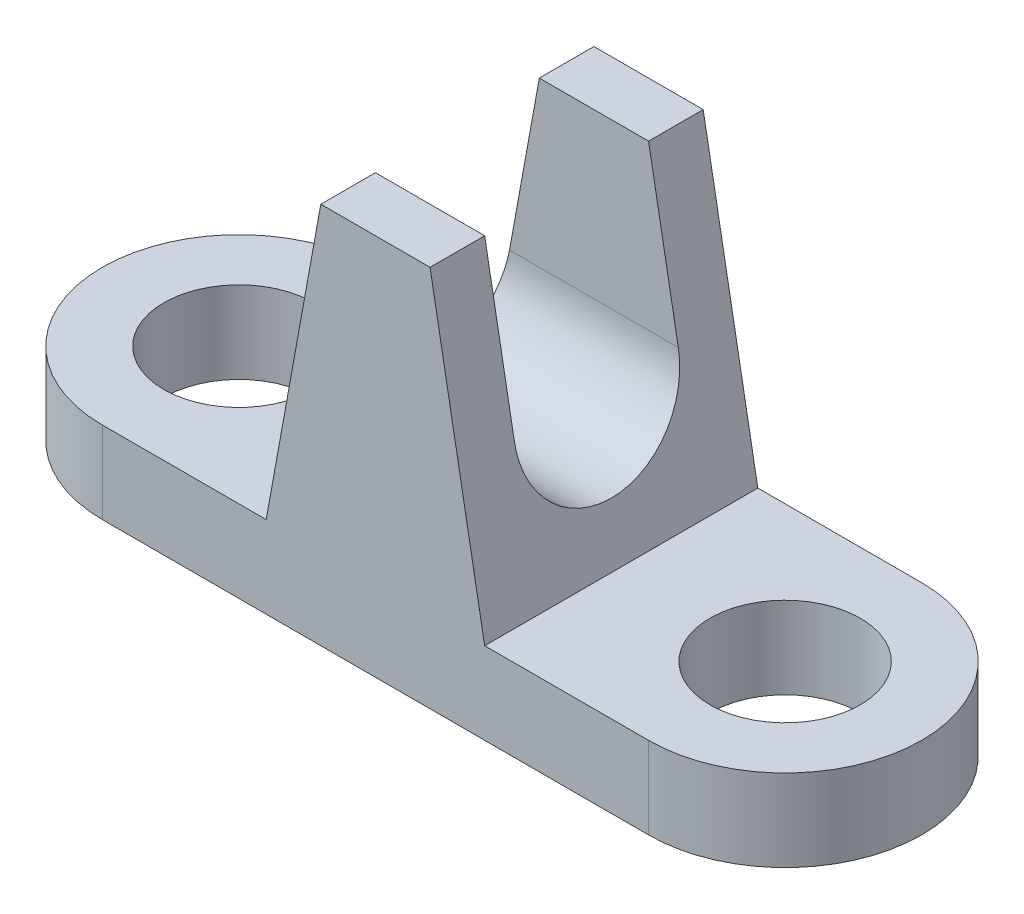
from build123d import *

# Parameters (mm, degrees)
SKETCH1_R          = 11
EXTRUDE1_DEPTH     = 12
EXTRUDE2_DEPTH     = 20
CUT_EXTRUDE1_DEPTH = 20


with BuildPart() as part:
    # Sketch1 → Extrude1 (new body)
    with BuildSketch(Plane(origin=(0, 0, 0), x_dir=(1, 0, 0), z_dir=(0, 1, 0))):
        with BuildLine():
            Line((-40, -20), (40, -20))
            ThreePointArc((40, -20), (60, 0), (40, 20))
            Line((40, 20), (-40, 20))
            ThreePointArc((-40, 20), (-60, 0), (-40, -20))
        make_face()
        with Locations(Location((-40, 0, 0), (0, 0, 270))):
            Circle(SKETCH1_R, mode=Mode.SUBTRACT)
        with Locations(Location((40, 0, 0), (0, 0, 270))):
            Circle(SKETCH1_R, mode=Mode.SUBTRACT)
    extrude(amount=EXTRUDE1_DEPTH)

    # Sketch2 → Extrude2 (add, symmetric)
    with BuildSketch(Plane.XY):
        Polygon((-16, 12), (16, 12), (8, 56), (-8, 56), align=None)
    extrude(amount=EXTRUDE2_DEPTH, both=True)

    # Sketch3 → Cut-Extrude1 (cut, symmetric)
    with BuildSketch(Plane(origin=(0, 0, 0), x_dir=(0, 0, -1), z_dir=(1, 0, 0))):
        with BuildLine():
            Line((-12, 56), (12, 56))
            Line((12, 56), (12, 32))
            ThreePointArc((12, 32), (0, 20), (-12, 32))
            Line((-12, 32), (-12, 56))
        make_face()
    extrude(amount=CUT_EXTRUDE1_DEPTH, both=True, mode=Mode.SUBTRACT)


solid = part.part
